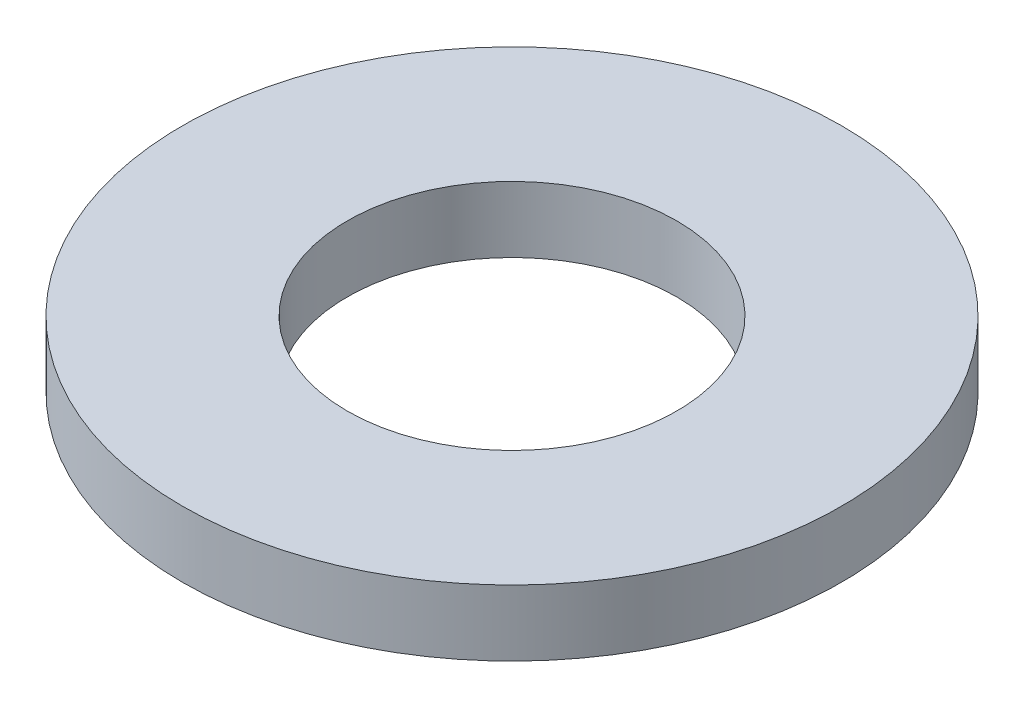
from build123d import *

# Parameters (mm, degrees)
SKETCH1_R           = 6.35
SKETCH1_R_2         = 3.175
BOSS_EXTRUDE1_DEPTH = 1.27


with BuildPart() as part:
    # Sketch1 → Boss-Extrude1 (new body)
    with BuildSketch(Plane(origin=(0, 0, 0), x_dir=(1, 0, 0), z_dir=(0, 1, 0))):
        with Locations(Location((0, 0, 0), (0, 0, 270))):
            Circle(SKETCH1_R)
        with Locations(Location((0, 0, 0), (0, 0, 270))):
            Circle(SKETCH1_R_2, mode=Mode.SUBTRACT)
    extrude(amount=BOSS_EXTRUDE1_DEPTH)


solid = part.part
